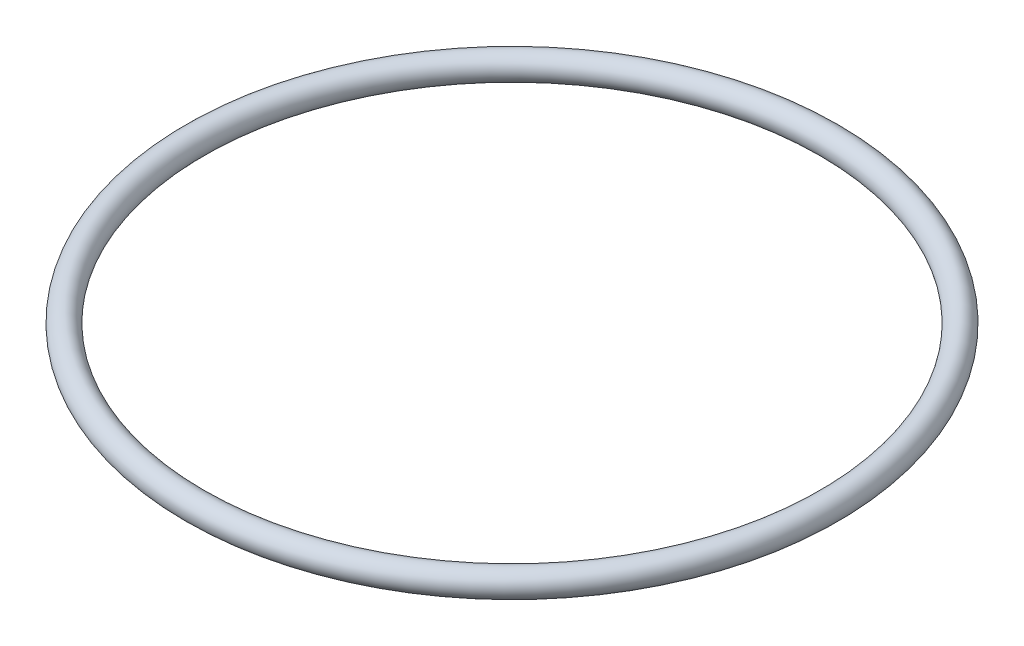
ISO-10303-21;
HEADER;
FILE_DESCRIPTION(('STEP AP214'),'2;1');
FILE_NAME('part.step','',(''),(''),'','','');
FILE_SCHEMA(('AUTOMOTIVE_DESIGN { 1 0 10303 214 1 1 1 1 }'));
ENDSEC;
DATA;
#1=APPLICATION_CONTEXT('core data for automotive mechanical design processes');
#2=APPLICATION_PROTOCOL_DEFINITION('international standard','automotive_design',2000,#1);
#3=PRODUCT_CONTEXT('',#1,'mechanical');
#4=PRODUCT('Part','Part','',(#3));
#5=PRODUCT_RELATED_PRODUCT_CATEGORY('part','',(#4));
#6=PRODUCT_DEFINITION_FORMATION('','',#4);
#7=PRODUCT_DEFINITION_CONTEXT('part definition',#1,'design');
#8=PRODUCT_DEFINITION('design','',#6,#7);
#9=PRODUCT_DEFINITION_SHAPE('','',#8);
#10=(LENGTH_UNIT() NAMED_UNIT(*) SI_UNIT(.MILLI.,.METRE.));
#11=(NAMED_UNIT(*) PLANE_ANGLE_UNIT() SI_UNIT($,.RADIAN.));
#12=(NAMED_UNIT(*) SI_UNIT($,.STERADIAN.) SOLID_ANGLE_UNIT());
#13=UNCERTAINTY_MEASURE_WITH_UNIT(LENGTH_MEASURE(1.E-05),#10,'distance_accuracy_value','');
#14=(GEOMETRIC_REPRESENTATION_CONTEXT(3) GLOBAL_UNCERTAINTY_ASSIGNED_CONTEXT((#13)) GLOBAL_UNIT_ASSIGNED_CONTEXT((#10,
#11,#12)) REPRESENTATION_CONTEXT('',''));
#15=CARTESIAN_POINT('',(0.,0.,0.));
#16=DIRECTION('',(0.,0.,1.));
#17=DIRECTION('',(1.,0.,0.));
#18=AXIS2_PLACEMENT_3D('',#15,#16,#17);
#19=CARTESIAN_POINT('',(0.,0.785481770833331,0.));
#20=DIRECTION('',(0.,-1.,0.));
#21=DIRECTION('',(0.,0.,-1.));
#22=AXIS2_PLACEMENT_3D('',#19,#20,#21);
#23=TOROIDAL_SURFACE('',#22,49.53,1.984375);
#24=CARTESIAN_POINT('',(0.,0.785481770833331,-51.514375));
#25=VERTEX_POINT('',#24);
#26=VERTEX_LOOP('',#25);
#27=FACE_BOUND('',#26,.T.);
#28=ADVANCED_FACE('F33',(#27),#23,.T.);
#29=CLOSED_SHELL('',(#28));
#30=MANIFOLD_SOLID_BREP('B2',#29);
#31=ADVANCED_BREP_SHAPE_REPRESENTATION('',(#18,#30),#14);
#32=SHAPE_DEFINITION_REPRESENTATION(#9,#31);
ENDSEC;
END-ISO-10303-21;
